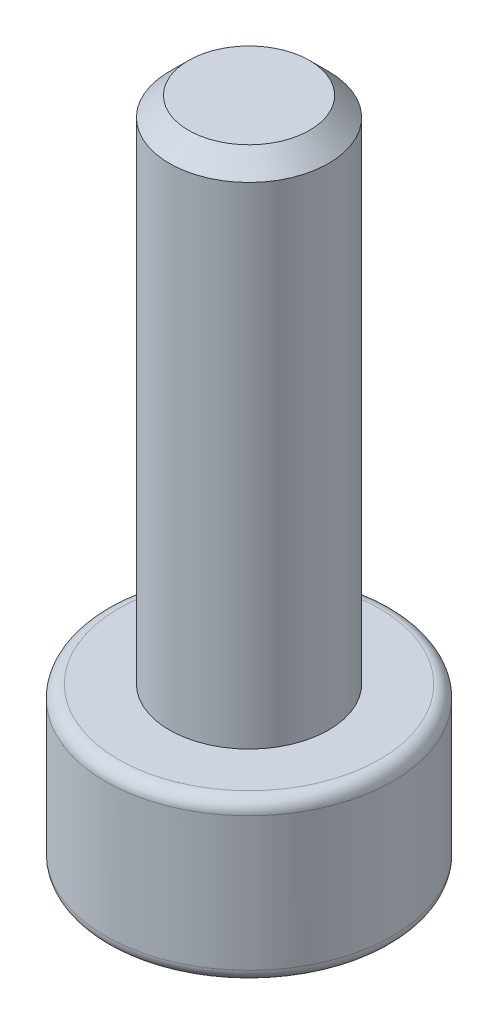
ISO-10303-21;
HEADER;
FILE_DESCRIPTION(('STEP AP214'),'2;1');
FILE_NAME('part.step','',(''),(''),'','','');
FILE_SCHEMA(('AUTOMOTIVE_DESIGN { 1 0 10303 214 1 1 1 1 }'));
ENDSEC;
DATA;
#1=APPLICATION_CONTEXT('core data for automotive mechanical design processes');
#2=APPLICATION_PROTOCOL_DEFINITION('international standard','automotive_design',2000,#1);
#3=PRODUCT_CONTEXT('',#1,'mechanical');
#4=PRODUCT('Part','Part','',(#3));
#5=PRODUCT_RELATED_PRODUCT_CATEGORY('part','',(#4));
#6=PRODUCT_DEFINITION_FORMATION('','',#4);
#7=PRODUCT_DEFINITION_CONTEXT('part definition',#1,'design');
#8=PRODUCT_DEFINITION('design','',#6,#7);
#9=PRODUCT_DEFINITION_SHAPE('','',#8);
#10=(LENGTH_UNIT() NAMED_UNIT(*) SI_UNIT(.MILLI.,.METRE.));
#11=(NAMED_UNIT(*) PLANE_ANGLE_UNIT() SI_UNIT($,.RADIAN.));
#12=(NAMED_UNIT(*) SI_UNIT($,.STERADIAN.) SOLID_ANGLE_UNIT());
#13=UNCERTAINTY_MEASURE_WITH_UNIT(LENGTH_MEASURE(1.E-05),#10,'distance_accuracy_value','');
#14=(GEOMETRIC_REPRESENTATION_CONTEXT(3) GLOBAL_UNCERTAINTY_ASSIGNED_CONTEXT((#13)) GLOBAL_UNIT_ASSIGNED_CONTEXT((#10,
#11,#12)) REPRESENTATION_CONTEXT('',''));
#15=CARTESIAN_POINT('',(0.,0.,0.));
#16=DIRECTION('',(0.,0.,1.));
#17=DIRECTION('',(1.,0.,0.));
#18=AXIS2_PLACEMENT_3D('',#15,#16,#17);
#19=CARTESIAN_POINT('',(0.,1.5,0.));
#20=DIRECTION('',(0.,-1.,0.));
#21=DIRECTION('',(0.,0.,-1.));
#22=AXIS2_PLACEMENT_3D('',#19,#20,#21);
#23=PLANE('',#22);
#24=DIRECTION('',(-0.866025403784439,0.,-0.5));
#25=VECTOR('',#24,1.);
#26=CARTESIAN_POINT('',(0.,1.5,-1.15470053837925));
#27=LINE('',#26,#25);
#28=CARTESIAN_POINT('',(0.,1.5,-1.15470053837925));
#29=VERTEX_POINT('',#28);
#30=CARTESIAN_POINT('',(1.,1.5,-0.577350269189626));
#31=VERTEX_POINT('',#30);
#32=EDGE_CURVE('E104',#29,#31,#27,.F.);
#33=ORIENTED_EDGE('',*,*,#32,.T.);
#34=DIRECTION('',(0.,0.,-1.));
#35=VECTOR('',#34,1.);
#36=CARTESIAN_POINT('',(1.,1.5,-0.577350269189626));
#37=LINE('',#36,#35);
#38=CARTESIAN_POINT('',(1.,1.5,0.577350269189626));
#39=VERTEX_POINT('',#38);
#40=EDGE_CURVE('E185',#31,#39,#37,.F.);
#41=ORIENTED_EDGE('',*,*,#40,.T.);
#42=DIRECTION('',(0.866025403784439,0.,-0.5));
#43=VECTOR('',#42,1.);
#44=CARTESIAN_POINT('',(1.,1.5,0.577350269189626));
#45=LINE('',#44,#43);
#46=CARTESIAN_POINT('',(0.,1.5,1.15470053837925));
#47=VERTEX_POINT('',#46);
#48=EDGE_CURVE('E180',#39,#47,#45,.F.);
#49=ORIENTED_EDGE('',*,*,#48,.T.);
#50=DIRECTION('',(0.866025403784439,0.,0.5));
#51=VECTOR('',#50,1.);
#52=CARTESIAN_POINT('',(0.,1.5,1.15470053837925));
#53=LINE('',#52,#51);
#54=CARTESIAN_POINT('',(-1.,1.5,0.577350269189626));
#55=VERTEX_POINT('',#54);
#56=EDGE_CURVE('E87',#47,#55,#53,.F.);
#57=ORIENTED_EDGE('',*,*,#56,.T.);
#58=DIRECTION('',(0.,0.,1.));
#59=VECTOR('',#58,1.);
#60=CARTESIAN_POINT('',(-1.,1.5,0.577350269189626));
#61=LINE('',#60,#59);
#62=CARTESIAN_POINT('',(-1.,1.5,-0.577350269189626));
#63=VERTEX_POINT('',#62);
#64=EDGE_CURVE('E84',#55,#63,#61,.F.);
#65=ORIENTED_EDGE('',*,*,#64,.T.);
#66=DIRECTION('',(-0.866025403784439,0.,0.5));
#67=VECTOR('',#66,1.);
#68=CARTESIAN_POINT('',(-1.,1.5,-0.577350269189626));
#69=LINE('',#68,#67);
#70=EDGE_CURVE('E81',#63,#29,#69,.F.);
#71=ORIENTED_EDGE('',*,*,#70,.T.);
#72=EDGE_LOOP('',(#33,#41,#49,#57,#65,#71));
#73=FACE_BOUND('',#72,.T.);
#74=ADVANCED_FACE('F17',(#73),#23,.T.);
#75=CARTESIAN_POINT('',(-1.,1.5,0.577350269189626));
#76=DIRECTION('',(-1.,0.,0.));
#77=DIRECTION('',(0.,0.,1.));
#78=AXIS2_PLACEMENT_3D('',#75,#76,#77);
#79=PLANE('',#78);
#80=DIRECTION('',(0.,1.,0.));
#81=VECTOR('',#80,1.);
#82=CARTESIAN_POINT('',(-1.,1.5,-0.577350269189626));
#83=LINE('',#82,#81);
#84=CARTESIAN_POINT('',(-1.,0.,-0.577350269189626));
#85=VERTEX_POINT('',#84);
#86=EDGE_CURVE('E90',#85,#63,#83,.T.);
#87=ORIENTED_EDGE('',*,*,#86,.T.);
#88=ORIENTED_EDGE('',*,*,#64,.F.);
#89=DIRECTION('',(0.,1.,0.));
#90=VECTOR('',#89,1.);
#91=CARTESIAN_POINT('',(-1.,1.5,0.577350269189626));
#92=LINE('',#91,#90);
#93=CARTESIAN_POINT('',(-1.,0.,0.577350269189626));
#94=VERTEX_POINT('',#93);
#95=EDGE_CURVE('E169',#55,#94,#92,.F.);
#96=ORIENTED_EDGE('',*,*,#95,.T.);
#97=DIRECTION('',(0.,0.,1.));
#98=VECTOR('',#97,1.);
#99=CARTESIAN_POINT('',(-1.,0.,0.));
#100=LINE('',#99,#98);
#101=EDGE_CURVE('E95',#94,#85,#100,.F.);
#102=ORIENTED_EDGE('',*,*,#101,.T.);
#103=EDGE_LOOP('',(#87,#88,#96,#102));
#104=FACE_BOUND('',#103,.T.);
#105=ADVANCED_FACE('F93',(#104),#79,.F.);
#106=CARTESIAN_POINT('',(-1.,1.5,-0.577350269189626));
#107=DIRECTION('',(-0.5,0.,-0.866025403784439));
#108=DIRECTION('',(-0.866025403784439,0.,0.5));
#109=AXIS2_PLACEMENT_3D('',#106,#107,#108);
#110=PLANE('',#109);
#111=DIRECTION('',(0.,1.,0.));
#112=VECTOR('',#111,1.);
#113=CARTESIAN_POINT('',(0.,1.5,-1.15470053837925));
#114=LINE('',#113,#112);
#115=CARTESIAN_POINT('',(0.,0.,-1.15470053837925));
#116=VERTEX_POINT('',#115);
#117=EDGE_CURVE('E101',#116,#29,#114,.T.);
#118=ORIENTED_EDGE('',*,*,#117,.T.);
#119=ORIENTED_EDGE('',*,*,#70,.F.);
#120=ORIENTED_EDGE('',*,*,#86,.F.);
#121=DIRECTION('',(0.866025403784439,0.,-0.5));
#122=VECTOR('',#121,1.);
#123=CARTESIAN_POINT('',(-1.,0.,-0.577350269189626));
#124=LINE('',#123,#122);
#125=EDGE_CURVE('E214',#85,#116,#124,.T.);
#126=ORIENTED_EDGE('',*,*,#125,.T.);
#127=EDGE_LOOP('',(#118,#119,#120,#126));
#128=FACE_BOUND('',#127,.T.);
#129=ADVANCED_FACE('F99',(#128),#110,.F.);
#130=CARTESIAN_POINT('',(0.,1.5,-1.15470053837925));
#131=DIRECTION('',(0.5,0.,-0.866025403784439));
#132=DIRECTION('',(-0.866025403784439,0.,-0.5));
#133=AXIS2_PLACEMENT_3D('',#130,#131,#132);
#134=PLANE('',#133);
#135=DIRECTION('',(0.,1.,0.));
#136=VECTOR('',#135,1.);
#137=CARTESIAN_POINT('',(1.,1.5,-0.577350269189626));
#138=LINE('',#137,#136);
#139=CARTESIAN_POINT('',(1.,0.,-0.577350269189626));
#140=VERTEX_POINT('',#139);
#141=EDGE_CURVE('E187',#140,#31,#138,.T.);
#142=ORIENTED_EDGE('',*,*,#141,.T.);
#143=ORIENTED_EDGE('',*,*,#32,.F.);
#144=ORIENTED_EDGE('',*,*,#117,.F.);
#145=DIRECTION('',(0.866025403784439,0.,0.5));
#146=VECTOR('',#145,1.);
#147=CARTESIAN_POINT('',(0.,0.,-1.15470053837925));
#148=LINE('',#147,#146);
#149=EDGE_CURVE('E194',#116,#140,#148,.T.);
#150=ORIENTED_EDGE('',*,*,#149,.T.);
#151=EDGE_LOOP('',(#142,#143,#144,#150));
#152=FACE_BOUND('',#151,.T.);
#153=ADVANCED_FACE('F192',(#152),#134,.F.);
#154=CARTESIAN_POINT('',(1.,1.5,-0.577350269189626));
#155=DIRECTION('',(1.,0.,0.));
#156=DIRECTION('',(0.,0.,-1.));
#157=AXIS2_PLACEMENT_3D('',#154,#155,#156);
#158=PLANE('',#157);
#159=DIRECTION('',(0.,1.,0.));
#160=VECTOR('',#159,1.);
#161=CARTESIAN_POINT('',(1.,1.5,0.577350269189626));
#162=LINE('',#161,#160);
#163=CARTESIAN_POINT('',(1.,0.,0.577350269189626));
#164=VERTEX_POINT('',#163);
#165=EDGE_CURVE('E182',#164,#39,#162,.T.);
#166=ORIENTED_EDGE('',*,*,#165,.T.);
#167=ORIENTED_EDGE('',*,*,#40,.F.);
#168=ORIENTED_EDGE('',*,*,#141,.F.);
#169=DIRECTION('',(0.,0.,1.));
#170=VECTOR('',#169,1.);
#171=CARTESIAN_POINT('',(1.,0.,0.));
#172=LINE('',#171,#170);
#173=EDGE_CURVE('E200',#140,#164,#172,.T.);
#174=ORIENTED_EDGE('',*,*,#173,.T.);
#175=EDGE_LOOP('',(#166,#167,#168,#174));
#176=FACE_BOUND('',#175,.T.);
#177=ADVANCED_FACE('F197',(#176),#158,.F.);
#178=CARTESIAN_POINT('',(1.,1.5,0.577350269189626));
#179=DIRECTION('',(0.5,0.,0.866025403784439));
#180=DIRECTION('',(0.866025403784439,0.,-0.5));
#181=AXIS2_PLACEMENT_3D('',#178,#179,#180);
#182=PLANE('',#181);
#183=DIRECTION('',(0.,1.,0.));
#184=VECTOR('',#183,1.);
#185=CARTESIAN_POINT('',(0.,1.5,1.15470053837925));
#186=LINE('',#185,#184);
#187=CARTESIAN_POINT('',(0.,0.,1.15470053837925));
#188=VERTEX_POINT('',#187);
#189=EDGE_CURVE('E177',#188,#47,#186,.T.);
#190=ORIENTED_EDGE('',*,*,#189,.T.);
#191=ORIENTED_EDGE('',*,*,#48,.F.);
#192=ORIENTED_EDGE('',*,*,#165,.F.);
#193=DIRECTION('',(-0.866025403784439,0.,0.5));
#194=VECTOR('',#193,1.);
#195=CARTESIAN_POINT('',(1.,0.,0.577350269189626));
#196=LINE('',#195,#194);
#197=EDGE_CURVE('E205',#164,#188,#196,.T.);
#198=ORIENTED_EDGE('',*,*,#197,.T.);
#199=EDGE_LOOP('',(#190,#191,#192,#198));
#200=FACE_BOUND('',#199,.T.);
#201=ADVANCED_FACE('F203',(#200),#182,.F.);
#202=CARTESIAN_POINT('',(0.,1.5,1.15470053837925));
#203=DIRECTION('',(-0.5,0.,0.866025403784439));
#204=DIRECTION('',(0.866025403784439,0.,0.5));
#205=AXIS2_PLACEMENT_3D('',#202,#203,#204);
#206=PLANE('',#205);
#207=ORIENTED_EDGE('',*,*,#95,.F.);
#208=ORIENTED_EDGE('',*,*,#56,.F.);
#209=ORIENTED_EDGE('',*,*,#189,.F.);
#210=DIRECTION('',(-0.866025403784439,0.,-0.5));
#211=VECTOR('',#210,1.);
#212=CARTESIAN_POINT('',(0.,0.,1.15470053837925));
#213=LINE('',#212,#211);
#214=EDGE_CURVE('E210',#188,#94,#213,.T.);
#215=ORIENTED_EDGE('',*,*,#214,.T.);
#216=EDGE_LOOP('',(#207,#208,#209,#215));
#217=FACE_BOUND('',#216,.T.);
#218=ADVANCED_FACE('F209',(#217),#206,.F.);
#219=CARTESIAN_POINT('',(0.,0.,0.));
#220=DIRECTION('',(0.,1.,0.));
#221=DIRECTION('',(0.,0.,1.));
#222=AXIS2_PLACEMENT_3D('',#219,#220,#221);
#223=PLANE('',#222);
#224=CARTESIAN_POINT('',(0.,0.,0.));
#225=DIRECTION('',(0.,1.,0.));
#226=DIRECTION('',(0.,0.,1.));
#227=AXIS2_PLACEMENT_3D('',#224,#225,#226);
#228=CIRCLE('',#227,2.05);
#229=CARTESIAN_POINT('',(0.,0.,2.05));
#230=VERTEX_POINT('',#229);
#231=CARTESIAN_POINT('',(0.,0.,-2.05));
#232=VERTEX_POINT('',#231);
#233=EDGE_CURVE('E212',#230,#232,#228,.T.);
#234=ORIENTED_EDGE('',*,*,#233,.F.);
#235=CARTESIAN_POINT('',(0.,0.,0.));
#236=DIRECTION('',(0.,1.,0.));
#237=DIRECTION('',(0.,0.,-1.));
#238=AXIS2_PLACEMENT_3D('',#235,#236,#237);
#239=CIRCLE('',#238,2.05);
#240=EDGE_CURVE('E231',#232,#230,#239,.T.);
#241=ORIENTED_EDGE('',*,*,#240,.F.);
#242=EDGE_LOOP('',(#234,#241));
#243=FACE_BOUND('',#242,.T.);
#244=ORIENTED_EDGE('',*,*,#197,.F.);
#245=ORIENTED_EDGE('',*,*,#173,.F.);
#246=ORIENTED_EDGE('',*,*,#149,.F.);
#247=ORIENTED_EDGE('',*,*,#125,.F.);
#248=ORIENTED_EDGE('',*,*,#101,.F.);
#249=ORIENTED_EDGE('',*,*,#214,.F.);
#250=EDGE_LOOP('',(#244,#245,#246,#247,#248,#249));
#251=FACE_BOUND('',#250,.T.);
#252=ADVANCED_FACE('F157',(#243,#251),#223,.F.);
#253=CARTESIAN_POINT('',(0.,0.2,0.));
#254=DIRECTION('',(0.,1.,0.));
#255=DIRECTION('',(0.,0.,1.));
#256=AXIS2_PLACEMENT_3D('',#253,#254,#255);
#257=TOROIDAL_SURFACE('',#256,2.05,0.2);
#258=ORIENTED_EDGE('',*,*,#233,.T.);
#259=ORIENTED_EDGE('',*,*,#240,.T.);
#260=EDGE_LOOP('',(#258,#259));
#261=FACE_BOUND('',#260,.T.);
#262=CARTESIAN_POINT('',(0.,0.2,0.));
#263=DIRECTION('',(0.,-1.,0.));
#264=DIRECTION('',(0.,0.,-1.));
#265=AXIS2_PLACEMENT_3D('',#262,#263,#264);
#266=CIRCLE('',#265,2.25);
#267=CARTESIAN_POINT('',(0.,0.2,-2.25));
#268=VERTEX_POINT('',#267);
#269=EDGE_CURVE('E148',#268,#268,#266,.F.);
#270=ORIENTED_EDGE('',*,*,#269,.F.);
#271=EDGE_LOOP('',(#270));
#272=FACE_BOUND('',#271,.T.);
#273=ADVANCED_FACE('F152',(#261,#272),#257,.T.);
#274=CARTESIAN_POINT('',(0.,2.5,0.));
#275=DIRECTION('',(0.,-1.,0.));
#276=DIRECTION('',(0.,0.,-1.));
#277=AXIS2_PLACEMENT_3D('',#274,#275,#276);
#278=CYLINDRICAL_SURFACE('',#277,2.25);
#279=CARTESIAN_POINT('',(0.,2.3,0.));
#280=DIRECTION('',(0.,1.,0.));
#281=DIRECTION('',(0.,0.,1.));
#282=AXIS2_PLACEMENT_3D('',#279,#280,#281);
#283=CIRCLE('',#282,2.25);
#284=CARTESIAN_POINT('',(0.,2.3,2.25));
#285=VERTEX_POINT('',#284);
#286=EDGE_CURVE('E112',#285,#285,#283,.T.);
#287=ORIENTED_EDGE('',*,*,#286,.F.);
#288=EDGE_LOOP('',(#287));
#289=FACE_BOUND('',#288,.T.);
#290=ORIENTED_EDGE('',*,*,#269,.T.);
#291=EDGE_LOOP('',(#290));
#292=FACE_BOUND('',#291,.T.);
#293=ADVANCED_FACE('F156',(#289,#292),#278,.T.);
#294=CARTESIAN_POINT('',(0.,10.5,0.));
#295=DIRECTION('',(0.,1.,0.));
#296=DIRECTION('',(0.,0.,1.));
#297=AXIS2_PLACEMENT_3D('',#294,#295,#296);
#298=PLANE('',#297);
#299=CARTESIAN_POINT('',(0.,10.5000000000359,0.));
#300=DIRECTION('',(0.,-1.,0.));
#301=DIRECTION('',(0.,0.,-1.));
#302=AXIS2_PLACEMENT_3D('',#299,#300,#301);
#303=CIRCLE('',#302,0.949999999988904);
#304=CARTESIAN_POINT('',(0.,10.5000000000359,-0.949999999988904));
#305=VERTEX_POINT('',#304);
#306=EDGE_CURVE('E108',#305,#305,#303,.T.);
#307=ORIENTED_EDGE('',*,*,#306,.F.);
#308=EDGE_LOOP('',(#307));
#309=FACE_BOUND('',#308,.T.);
#310=ADVANCED_FACE('F129',(#309),#298,.T.);
#311=CARTESIAN_POINT('',(0.,2.3,0.));
#312=DIRECTION('',(0.,1.,0.));
#313=DIRECTION('',(0.,0.,1.));
#314=AXIS2_PLACEMENT_3D('',#311,#312,#313);
#315=TOROIDAL_SURFACE('',#314,2.05,0.2);
#316=ORIENTED_EDGE('',*,*,#286,.T.);
#317=EDGE_LOOP('',(#316));
#318=FACE_BOUND('',#317,.T.);
#319=CARTESIAN_POINT('',(0.,2.5,0.));
#320=DIRECTION('',(0.,-1.,0.));
#321=DIRECTION('',(0.,0.,1.));
#322=AXIS2_PLACEMENT_3D('',#319,#320,#321);
#323=CIRCLE('',#322,2.05);
#324=CARTESIAN_POINT('',(0.,2.5,-2.05));
#325=VERTEX_POINT('',#324);
#326=CARTESIAN_POINT('',(0.,2.5,2.05));
#327=VERTEX_POINT('',#326);
#328=EDGE_CURVE('E36',#325,#327,#323,.F.);
#329=ORIENTED_EDGE('',*,*,#328,.F.);
#330=CARTESIAN_POINT('',(0.,2.5,0.));
#331=DIRECTION('',(0.,-1.,0.));
#332=DIRECTION('',(0.,0.,-1.));
#333=AXIS2_PLACEMENT_3D('',#330,#331,#332);
#334=CIRCLE('',#333,2.05);
#335=EDGE_CURVE('E111',#327,#325,#334,.F.);
#336=ORIENTED_EDGE('',*,*,#335,.F.);
#337=EDGE_LOOP('',(#329,#336));
#338=FACE_BOUND('',#337,.T.);
#339=ADVANCED_FACE('F117',(#318,#338),#315,.T.);
#340=CARTESIAN_POINT('',(0.,10.2000000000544,0.));
#341=DIRECTION('',(0.,-1.,0.));
#342=DIRECTION('',(0.,0.,-1.));
#343=AXIS2_PLACEMENT_3D('',#340,#341,#342);
#344=CONICAL_SURFACE('',#343,1.24999999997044,0.785398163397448);
#345=CARTESIAN_POINT('',(0.,10.2,0.));
#346=DIRECTION('',(0.,-1.,0.));
#347=DIRECTION('',(0.,0.,-1.));
#348=AXIS2_PLACEMENT_3D('',#345,#346,#347);
#349=CIRCLE('',#348,1.25);
#350=CARTESIAN_POINT('',(0.,10.2,-1.25));
#351=VERTEX_POINT('',#350);
#352=EDGE_CURVE('E28',#351,#351,#349,.T.);
#353=ORIENTED_EDGE('',*,*,#352,.F.);
#354=EDGE_LOOP('',(#353));
#355=FACE_BOUND('',#354,.T.);
#356=ORIENTED_EDGE('',*,*,#306,.T.);
#357=EDGE_LOOP('',(#356));
#358=FACE_BOUND('',#357,.T.);
#359=ADVANCED_FACE('F128',(#355,#358),#344,.T.);
#360=CARTESIAN_POINT('',(0.,2.5,0.));
#361=DIRECTION('',(0.,1.,0.));
#362=DIRECTION('',(0.,0.,1.));
#363=AXIS2_PLACEMENT_3D('',#360,#361,#362);
#364=PLANE('',#363);
#365=CARTESIAN_POINT('',(0.,2.5,0.));
#366=DIRECTION('',(0.,-1.,0.));
#367=DIRECTION('',(0.,0.,-1.));
#368=AXIS2_PLACEMENT_3D('',#365,#366,#367);
#369=CIRCLE('',#368,1.25);
#370=CARTESIAN_POINT('',(0.,2.5,-1.25));
#371=VERTEX_POINT('',#370);
#372=EDGE_CURVE('E11',#371,#371,#369,.F.);
#373=ORIENTED_EDGE('',*,*,#372,.F.);
#374=EDGE_LOOP('',(#373));
#375=FACE_BOUND('',#374,.T.);
#376=ORIENTED_EDGE('',*,*,#335,.T.);
#377=ORIENTED_EDGE('',*,*,#328,.T.);
#378=EDGE_LOOP('',(#376,#377));
#379=FACE_BOUND('',#378,.T.);
#380=ADVANCED_FACE('F253',(#375,#379),#364,.T.);
#381=CARTESIAN_POINT('',(0.,10.5,0.));
#382=DIRECTION('',(0.,-1.,0.));
#383=DIRECTION('',(0.,0.,-1.));
#384=AXIS2_PLACEMENT_3D('',#381,#382,#383);
#385=CYLINDRICAL_SURFACE('',#384,1.25);
#386=ORIENTED_EDGE('',*,*,#372,.T.);
#387=EDGE_LOOP('',(#386));
#388=FACE_BOUND('',#387,.T.);
#389=ORIENTED_EDGE('',*,*,#352,.T.);
#390=EDGE_LOOP('',(#389));
#391=FACE_BOUND('',#390,.T.);
#392=ADVANCED_FACE('F251',(#388,#391),#385,.T.);
#393=CLOSED_SHELL('',(#74,#105,#129,#153,#177,#201,#218,#252,#273,#293,#310,#339,#359,#380,#392));
#394=MANIFOLD_SOLID_BREP('B1',#393);
#395=ADVANCED_BREP_SHAPE_REPRESENTATION('',(#18,#394),#14);
#396=SHAPE_DEFINITION_REPRESENTATION(#9,#395);
ENDSEC;
END-ISO-10303-21;
